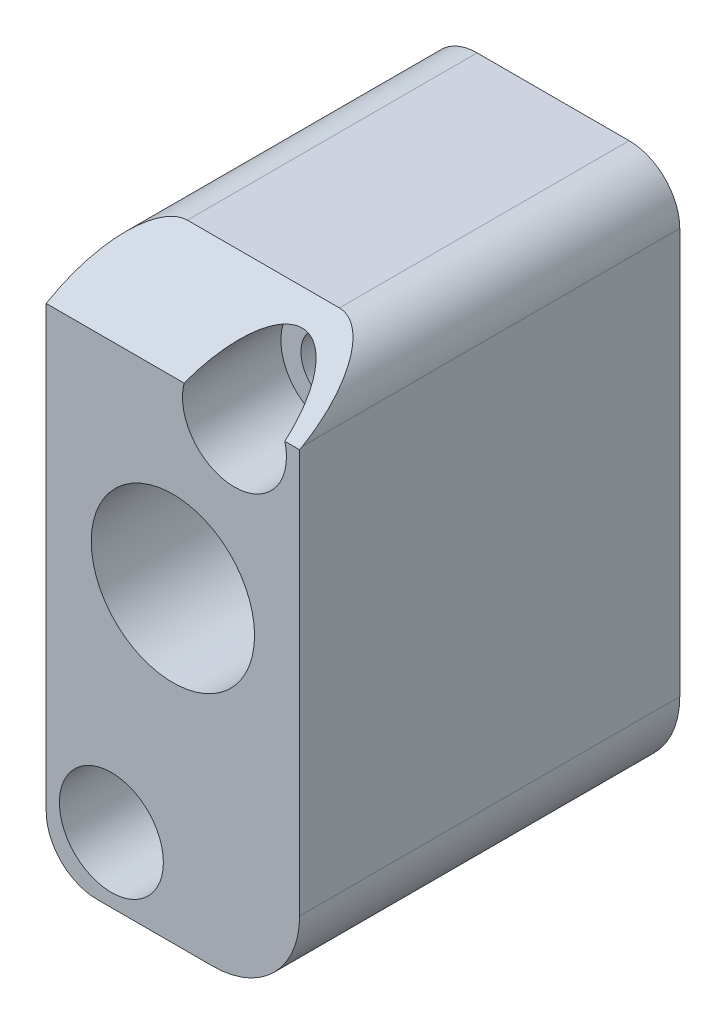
ISO-10303-21;
HEADER;
FILE_DESCRIPTION(('STEP AP214'),'2;1');
FILE_NAME('part.step','',(''),(''),'','','');
FILE_SCHEMA(('AUTOMOTIVE_DESIGN { 1 0 10303 214 1 1 1 1 }'));
ENDSEC;
DATA;
#1=APPLICATION_CONTEXT('core data for automotive mechanical design processes');
#2=APPLICATION_PROTOCOL_DEFINITION('international standard','automotive_design',2000,#1);
#3=PRODUCT_CONTEXT('',#1,'mechanical');
#4=PRODUCT('Part','Part','',(#3));
#5=PRODUCT_RELATED_PRODUCT_CATEGORY('part','',(#4));
#6=PRODUCT_DEFINITION_FORMATION('','',#4);
#7=PRODUCT_DEFINITION_CONTEXT('part definition',#1,'design');
#8=PRODUCT_DEFINITION('design','',#6,#7);
#9=PRODUCT_DEFINITION_SHAPE('','',#8);
#10=(LENGTH_UNIT() NAMED_UNIT(*) SI_UNIT(.MILLI.,.METRE.));
#11=(NAMED_UNIT(*) PLANE_ANGLE_UNIT() SI_UNIT($,.RADIAN.));
#12=(NAMED_UNIT(*) SI_UNIT($,.STERADIAN.) SOLID_ANGLE_UNIT());
#13=UNCERTAINTY_MEASURE_WITH_UNIT(LENGTH_MEASURE(1.E-05),#10,'distance_accuracy_value','');
#14=(GEOMETRIC_REPRESENTATION_CONTEXT(3) GLOBAL_UNCERTAINTY_ASSIGNED_CONTEXT((#13)) GLOBAL_UNIT_ASSIGNED_CONTEXT((#10,
#11,#12)) REPRESENTATION_CONTEXT('',''));
#15=CARTESIAN_POINT('',(0.,0.,0.));
#16=DIRECTION('',(0.,0.,1.));
#17=DIRECTION('',(1.,0.,0.));
#18=AXIS2_PLACEMENT_3D('',#15,#16,#17);
#19=CARTESIAN_POINT('',(-754.411295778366,-14.7238728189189,1.5998698));
#20=DIRECTION('',(0.,0.,-1.));
#21=DIRECTION('',(-1.,0.,0.));
#22=AXIS2_PLACEMENT_3D('',#19,#20,#21);
#23=CYLINDRICAL_SURFACE('',#22,4.44500000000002);
#24=DIRECTION('',(0.,0.,-1.));
#25=VECTOR('',#24,1.);
#26=CARTESIAN_POINT('',(-754.411295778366,-10.2788728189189,1.5998698));
#27=LINE('',#26,#25);
#28=CARTESIAN_POINT('',(-754.411295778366,-10.2788728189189,-6.33763020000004));
#29=VERTEX_POINT('',#28);
#30=CARTESIAN_POINT('',(-754.411295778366,-10.2788728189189,-31.75));
#31=VERTEX_POINT('',#30);
#32=EDGE_CURVE('E163',#29,#31,#27,.T.);
#33=ORIENTED_EDGE('',*,*,#32,.F.);
#34=CARTESIAN_POINT('',(-754.411295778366,-14.7238728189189,1.36133563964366));
#35=DIRECTION('',(0.,-0.86602540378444,-0.499999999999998));
#36=DIRECTION('',(0.,0.499999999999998,-0.86602540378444));
#37=AXIS2_PLACEMENT_3D('',#34,#35,#36);
#38=ELLIPSE('',#37,8.89000000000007,4.44500000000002);
#39=CARTESIAN_POINT('',(-749.966295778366,-14.7238728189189,1.36133563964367));
#40=VERTEX_POINT('',#39);
#41=EDGE_CURVE('E95',#29,#40,#38,.T.);
#42=ORIENTED_EDGE('',*,*,#41,.T.);
#43=DIRECTION('',(0.,0.,-1.));
#44=VECTOR('',#43,1.);
#45=CARTESIAN_POINT('',(-749.966295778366,-14.7238728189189,1.5998698));
#46=LINE('',#45,#44);
#47=CARTESIAN_POINT('',(-749.966295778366,-14.7238728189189,-31.75));
#48=VERTEX_POINT('',#47);
#49=EDGE_CURVE('E184',#40,#48,#46,.T.);
#50=ORIENTED_EDGE('',*,*,#49,.T.);
#51=CARTESIAN_POINT('',(-754.411295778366,-14.7238728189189,-31.75));
#52=DIRECTION('',(0.,0.,1.));
#53=DIRECTION('',(-1.,0.,0.));
#54=AXIS2_PLACEMENT_3D('',#51,#52,#53);
#55=CIRCLE('',#54,4.44500000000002);
#56=EDGE_CURVE('E177',#48,#31,#55,.T.);
#57=ORIENTED_EDGE('',*,*,#56,.T.);
#58=EDGE_LOOP('',(#33,#42,#50,#57));
#59=FACE_BOUND('',#58,.T.);
#60=ADVANCED_FACE('F85',(#59),#23,.T.);
#61=CARTESIAN_POINT('',(-767.746295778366,-10.2788728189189,1.5998698));
#62=DIRECTION('',(0.,-1.,0.));
#63=DIRECTION('',(1.,0.,0.));
#64=AXIS2_PLACEMENT_3D('',#61,#62,#63);
#65=PLANE('',#64);
#66=DIRECTION('',(0.,0.,-1.));
#67=VECTOR('',#66,1.);
#68=CARTESIAN_POINT('',(-767.746295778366,-10.2788728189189,1.5998698));
#69=LINE('',#68,#67);
#70=CARTESIAN_POINT('',(-767.746295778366,-10.2788728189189,-6.33763020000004));
#71=VERTEX_POINT('',#70);
#72=CARTESIAN_POINT('',(-767.746295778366,-10.2788728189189,-31.75));
#73=VERTEX_POINT('',#72);
#74=EDGE_CURVE('E170',#71,#73,#69,.T.);
#75=ORIENTED_EDGE('',*,*,#74,.F.);
#76=DIRECTION('',(1.,0.,0.));
#77=VECTOR('',#76,1.);
#78=CARTESIAN_POINT('',(-767.746295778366,-10.2788728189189,-6.33763020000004));
#79=LINE('',#78,#77);
#80=EDGE_CURVE('E109',#71,#29,#79,.T.);
#81=ORIENTED_EDGE('',*,*,#80,.T.);
#82=ORIENTED_EDGE('',*,*,#32,.T.);
#83=DIRECTION('',(-1.,0.,0.));
#84=VECTOR('',#83,1.);
#85=CARTESIAN_POINT('',(-767.746295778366,-10.2788728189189,-31.75));
#86=LINE('',#85,#84);
#87=EDGE_CURVE('E166',#31,#73,#86,.T.);
#88=ORIENTED_EDGE('',*,*,#87,.T.);
#89=EDGE_LOOP('',(#75,#81,#82,#88));
#90=FACE_BOUND('',#89,.T.);
#91=ADVANCED_FACE('F165',(#90),#65,.F.);
#92=CARTESIAN_POINT('',(-767.746295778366,-14.7238728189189,1.5998698));
#93=DIRECTION('',(0.,0.,-1.));
#94=DIRECTION('',(-1.,0.,0.));
#95=AXIS2_PLACEMENT_3D('',#92,#93,#94);
#96=CYLINDRICAL_SURFACE('',#95,4.44500000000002);
#97=DIRECTION('',(0.,0.,-1.));
#98=VECTOR('',#97,1.);
#99=CARTESIAN_POINT('',(-772.191295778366,-14.7238728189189,1.5998698));
#100=LINE('',#99,#98);
#101=CARTESIAN_POINT('',(-772.191295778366,-14.7238728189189,1.36133563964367));
#102=VERTEX_POINT('',#101);
#103=CARTESIAN_POINT('',(-772.191295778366,-14.7238728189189,-31.75));
#104=VERTEX_POINT('',#103);
#105=EDGE_CURVE('E246',#102,#104,#100,.T.);
#106=ORIENTED_EDGE('',*,*,#105,.F.);
#107=CARTESIAN_POINT('',(-767.746295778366,-14.7238728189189,1.36133563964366));
#108=DIRECTION('',(0.,-0.86602540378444,-0.499999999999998));
#109=DIRECTION('',(0.,0.499999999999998,-0.86602540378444));
#110=AXIS2_PLACEMENT_3D('',#107,#108,#109);
#111=ELLIPSE('',#110,8.89000000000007,4.44500000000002);
#112=EDGE_CURVE('E263',#102,#71,#111,.T.);
#113=ORIENTED_EDGE('',*,*,#112,.T.);
#114=ORIENTED_EDGE('',*,*,#74,.T.);
#115=CARTESIAN_POINT('',(-767.746295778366,-14.7238728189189,-31.75));
#116=DIRECTION('',(0.,0.,1.));
#117=DIRECTION('',(1.,0.,0.));
#118=AXIS2_PLACEMENT_3D('',#115,#116,#117);
#119=CIRCLE('',#118,4.44500000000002);
#120=EDGE_CURVE('E181',#73,#104,#119,.T.);
#121=ORIENTED_EDGE('',*,*,#120,.T.);
#122=EDGE_LOOP('',(#106,#113,#114,#121));
#123=FACE_BOUND('',#122,.T.);
#124=ADVANCED_FACE('F346',(#123),#96,.T.);
#125=CARTESIAN_POINT('',(-772.191295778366,-14.7238728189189,1.5998698));
#126=DIRECTION('',(1.,0.,0.));
#127=DIRECTION('',(0.,0.,-1.));
#128=AXIS2_PLACEMENT_3D('',#125,#126,#127);
#129=PLANE('',#128);
#130=DIRECTION('',(0.,-1.,0.));
#131=VECTOR('',#130,1.);
#132=CARTESIAN_POINT('',(-772.191295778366,-14.7238728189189,1.5998698));
#133=LINE('',#132,#131);
#134=CARTESIAN_POINT('',(-772.191295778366,-14.8615905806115,1.5998698));
#135=VERTEX_POINT('',#134);
#136=CARTESIAN_POINT('',(-772.191295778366,-53.4588728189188,1.5998698));
#137=VERTEX_POINT('',#136);
#138=EDGE_CURVE('E217',#135,#137,#133,.T.);
#139=ORIENTED_EDGE('',*,*,#138,.F.);
#140=DIRECTION('',(0.,-0.499999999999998,0.86602540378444));
#141=VECTOR('',#140,1.);
#142=CARTESIAN_POINT('',(-772.191295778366,-14.8615905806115,1.5998698));
#143=LINE('',#142,#141);
#144=EDGE_CURVE('E260',#135,#102,#143,.F.);
#145=ORIENTED_EDGE('',*,*,#144,.T.);
#146=ORIENTED_EDGE('',*,*,#105,.T.);
#147=DIRECTION('',(0.,-1.,0.));
#148=VECTOR('',#147,1.);
#149=CARTESIAN_POINT('',(-772.191295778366,-14.7238728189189,-31.75));
#150=LINE('',#149,#148);
#151=CARTESIAN_POINT('',(-772.191295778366,-53.4588728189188,-31.75));
#152=VERTEX_POINT('',#151);
#153=EDGE_CURVE('E198',#104,#152,#150,.T.);
#154=ORIENTED_EDGE('',*,*,#153,.T.);
#155=DIRECTION('',(0.,0.,-1.));
#156=VECTOR('',#155,1.);
#157=CARTESIAN_POINT('',(-772.191295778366,-53.4588728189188,1.5998698));
#158=LINE('',#157,#156);
#159=EDGE_CURVE('E243',#137,#152,#158,.T.);
#160=ORIENTED_EDGE('',*,*,#159,.F.);
#161=EDGE_LOOP('',(#139,#145,#146,#154,#160));
#162=FACE_BOUND('',#161,.T.);
#163=ADVANCED_FACE('F351',(#162),#129,.F.);
#164=CARTESIAN_POINT('',(-767.746295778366,-53.4588728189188,1.5998698));
#165=DIRECTION('',(0.,0.,-1.));
#166=DIRECTION('',(-1.,0.,0.));
#167=AXIS2_PLACEMENT_3D('',#164,#165,#166);
#168=CYLINDRICAL_SURFACE('',#167,4.44500000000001);
#169=ORIENTED_EDGE('',*,*,#159,.T.);
#170=CARTESIAN_POINT('',(-767.746295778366,-53.4588728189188,-31.75));
#171=DIRECTION('',(0.,0.,1.));
#172=DIRECTION('',(1.,0.,0.));
#173=AXIS2_PLACEMENT_3D('',#170,#171,#172);
#174=CIRCLE('',#173,4.44500000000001);
#175=CARTESIAN_POINT('',(-767.746295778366,-57.9038728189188,-31.75));
#176=VERTEX_POINT('',#175);
#177=EDGE_CURVE('E202',#152,#176,#174,.T.);
#178=ORIENTED_EDGE('',*,*,#177,.T.);
#179=DIRECTION('',(0.,0.,-1.));
#180=VECTOR('',#179,1.);
#181=CARTESIAN_POINT('',(-767.746295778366,-57.9038728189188,1.5998698));
#182=LINE('',#181,#180);
#183=CARTESIAN_POINT('',(-767.746295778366,-57.9038728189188,1.5998698));
#184=VERTEX_POINT('',#183);
#185=EDGE_CURVE('E240',#184,#176,#182,.T.);
#186=ORIENTED_EDGE('',*,*,#185,.F.);
#187=CARTESIAN_POINT('',(-767.746295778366,-53.4588728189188,1.5998698));
#188=DIRECTION('',(0.,0.,1.));
#189=DIRECTION('',(1.,0.,0.));
#190=AXIS2_PLACEMENT_3D('',#187,#188,#189);
#191=CIRCLE('',#190,4.44500000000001);
#192=EDGE_CURVE('E220',#137,#184,#191,.T.);
#193=ORIENTED_EDGE('',*,*,#192,.F.);
#194=EDGE_LOOP('',(#169,#178,#186,#193));
#195=FACE_BOUND('',#194,.T.);
#196=ADVANCED_FACE('F355',(#195),#168,.T.);
#197=CARTESIAN_POINT('',(-767.746295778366,-57.9038728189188,1.5998698));
#198=DIRECTION('',(0.,1.,0.));
#199=DIRECTION('',(0.,0.,1.));
#200=AXIS2_PLACEMENT_3D('',#197,#198,#199);
#201=PLANE('',#200);
#202=ORIENTED_EDGE('',*,*,#185,.T.);
#203=DIRECTION('',(1.,0.,0.));
#204=VECTOR('',#203,1.);
#205=CARTESIAN_POINT('',(-767.746295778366,-57.9038728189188,-31.75));
#206=LINE('',#205,#204);
#207=CARTESIAN_POINT('',(-757.586295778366,-57.9038728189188,-31.75));
#208=VERTEX_POINT('',#207);
#209=EDGE_CURVE('E206',#176,#208,#206,.T.);
#210=ORIENTED_EDGE('',*,*,#209,.T.);
#211=DIRECTION('',(0.,0.,-1.));
#212=VECTOR('',#211,1.);
#213=CARTESIAN_POINT('',(-757.586295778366,-57.9038728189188,1.5998698));
#214=LINE('',#213,#212);
#215=CARTESIAN_POINT('',(-757.586295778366,-57.9038728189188,1.5998698));
#216=VERTEX_POINT('',#215);
#217=EDGE_CURVE('E237',#216,#208,#214,.T.);
#218=ORIENTED_EDGE('',*,*,#217,.F.);
#219=DIRECTION('',(1.,0.,0.));
#220=VECTOR('',#219,1.);
#221=CARTESIAN_POINT('',(-767.746295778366,-57.9038728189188,1.5998698));
#222=LINE('',#221,#220);
#223=EDGE_CURVE('E223',#184,#216,#222,.T.);
#224=ORIENTED_EDGE('',*,*,#223,.F.);
#225=EDGE_LOOP('',(#202,#210,#218,#224));
#226=FACE_BOUND('',#225,.T.);
#227=ADVANCED_FACE('F359',(#226),#201,.F.);
#228=CARTESIAN_POINT('',(-757.586295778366,-50.2838728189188,1.5998698));
#229=DIRECTION('',(0.,0.,-1.));
#230=DIRECTION('',(-1.,0.,0.));
#231=AXIS2_PLACEMENT_3D('',#228,#229,#230);
#232=CYLINDRICAL_SURFACE('',#231,7.61999999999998);
#233=ORIENTED_EDGE('',*,*,#217,.T.);
#234=CARTESIAN_POINT('',(-757.586295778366,-50.2838728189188,-31.75));
#235=DIRECTION('',(0.,0.,1.));
#236=DIRECTION('',(1.,0.,0.));
#237=AXIS2_PLACEMENT_3D('',#234,#235,#236);
#238=CIRCLE('',#237,7.61999999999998);
#239=CARTESIAN_POINT('',(-749.966295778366,-50.2838728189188,-31.75));
#240=VERTEX_POINT('',#239);
#241=EDGE_CURVE('E210',#208,#240,#238,.T.);
#242=ORIENTED_EDGE('',*,*,#241,.T.);
#243=DIRECTION('',(0.,0.,-1.));
#244=VECTOR('',#243,1.);
#245=CARTESIAN_POINT('',(-749.966295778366,-50.2838728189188,1.5998698));
#246=LINE('',#245,#244);
#247=CARTESIAN_POINT('',(-749.966295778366,-50.2838728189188,1.5998698));
#248=VERTEX_POINT('',#247);
#249=EDGE_CURVE('E234',#248,#240,#246,.T.);
#250=ORIENTED_EDGE('',*,*,#249,.F.);
#251=CARTESIAN_POINT('',(-757.586295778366,-50.2838728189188,1.5998698));
#252=DIRECTION('',(0.,0.,1.));
#253=DIRECTION('',(1.,0.,0.));
#254=AXIS2_PLACEMENT_3D('',#251,#252,#253);
#255=CIRCLE('',#254,7.61999999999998);
#256=EDGE_CURVE('E226',#216,#248,#255,.T.);
#257=ORIENTED_EDGE('',*,*,#256,.F.);
#258=EDGE_LOOP('',(#233,#242,#250,#257));
#259=FACE_BOUND('',#258,.T.);
#260=ADVANCED_FACE('F363',(#259),#232,.T.);
#261=CARTESIAN_POINT('',(-749.966295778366,-14.7238728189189,1.5998698));
#262=DIRECTION('',(-1.,0.,0.));
#263=DIRECTION('',(0.,0.,1.));
#264=AXIS2_PLACEMENT_3D('',#261,#262,#263);
#265=PLANE('',#264);
#266=ORIENTED_EDGE('',*,*,#49,.F.);
#267=DIRECTION('',(0.,0.499999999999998,-0.86602540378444));
#268=VECTOR('',#267,1.);
#269=CARTESIAN_POINT('',(-749.966295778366,-14.8615905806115,1.5998698));
#270=LINE('',#269,#268);
#271=CARTESIAN_POINT('',(-749.966295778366,-14.8615905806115,1.5998698));
#272=VERTEX_POINT('',#271);
#273=EDGE_CURVE('E12',#40,#272,#270,.F.);
#274=ORIENTED_EDGE('',*,*,#273,.T.);
#275=DIRECTION('',(0.,1.,0.));
#276=VECTOR('',#275,1.);
#277=CARTESIAN_POINT('',(-749.966295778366,-14.7238728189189,1.5998698));
#278=LINE('',#277,#276);
#279=EDGE_CURVE('E229',#248,#272,#278,.T.);
#280=ORIENTED_EDGE('',*,*,#279,.F.);
#281=ORIENTED_EDGE('',*,*,#249,.T.);
#282=DIRECTION('',(0.,1.,0.));
#283=VECTOR('',#282,1.);
#284=CARTESIAN_POINT('',(-749.966295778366,-14.7238728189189,-31.75));
#285=LINE('',#284,#283);
#286=EDGE_CURVE('E214',#240,#48,#285,.T.);
#287=ORIENTED_EDGE('',*,*,#286,.T.);
#288=EDGE_LOOP('',(#266,#274,#280,#281,#287));
#289=FACE_BOUND('',#288,.T.);
#290=ADVANCED_FACE('F335',(#289),#265,.F.);
#291=CARTESIAN_POINT('',(-754.411295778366,-14.7238728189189,1.5998698));
#292=DIRECTION('',(0.,0.,-1.));
#293=DIRECTION('',(-1.,0.,0.));
#294=AXIS2_PLACEMENT_3D('',#291,#292,#293);
#295=PLANE('',#294);
#296=ORIENTED_EDGE('',*,*,#279,.T.);
#297=DIRECTION('',(-1.,0.,0.));
#298=VECTOR('',#297,1.);
#299=CARTESIAN_POINT('',(-754.411295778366,-14.8615905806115,1.5998698));
#300=LINE('',#299,#298);
#301=CARTESIAN_POINT('',(-751.26483187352,-14.8615905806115,1.5998698));
#302=VERTEX_POINT('',#301);
#303=EDGE_CURVE('E253',#272,#302,#300,.T.);
#304=ORIENTED_EDGE('',*,*,#303,.T.);
#305=CARTESIAN_POINT('',(-755.681295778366,-15.9938728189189,1.5998698));
#306=DIRECTION('',(0.,0.,1.));
#307=DIRECTION('',(1.,0.,0.));
#308=AXIS2_PLACEMENT_3D('',#305,#306,#307);
#309=CIRCLE('',#308,4.55930000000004);
#310=CARTESIAN_POINT('',(-760.097759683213,-14.8615905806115,1.5998698));
#311=VERTEX_POINT('',#310);
#312=EDGE_CURVE('E280',#311,#302,#309,.T.);
#313=ORIENTED_EDGE('',*,*,#312,.F.);
#314=DIRECTION('',(-1.,0.,0.));
#315=VECTOR('',#314,1.);
#316=CARTESIAN_POINT('',(-754.411295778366,-14.8615905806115,1.5998698));
#317=LINE('',#316,#315);
#318=EDGE_CURVE('E169',#311,#135,#317,.T.);
#319=ORIENTED_EDGE('',*,*,#318,.T.);
#320=ORIENTED_EDGE('',*,*,#138,.T.);
#321=ORIENTED_EDGE('',*,*,#192,.T.);
#322=ORIENTED_EDGE('',*,*,#223,.T.);
#323=ORIENTED_EDGE('',*,*,#256,.T.);
#324=EDGE_LOOP('',(#296,#304,#313,#319,#320,#321,#322,#323));
#325=FACE_BOUND('',#324,.T.);
#326=CARTESIAN_POINT('',(-766.476295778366,-52.1888728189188,1.5998698));
#327=DIRECTION('',(0.,0.,1.));
#328=DIRECTION('',(1.,0.,0.));
#329=AXIS2_PLACEMENT_3D('',#326,#327,#328);
#330=CIRCLE('',#329,4.55930000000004);
#331=CARTESIAN_POINT('',(-761.916995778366,-52.1888728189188,1.5998698));
#332=VERTEX_POINT('',#331);
#333=EDGE_CURVE('E270',#332,#332,#330,.T.);
#334=ORIENTED_EDGE('',*,*,#333,.F.);
#335=EDGE_LOOP('',(#334));
#336=FACE_BOUND('',#335,.T.);
#337=CARTESIAN_POINT('',(-761.078795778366,-30.9504062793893,1.5998698));
#338=DIRECTION('',(0.,0.,-1.));
#339=DIRECTION('',(-1.,0.,0.));
#340=AXIS2_PLACEMENT_3D('',#337,#338,#339);
#341=CIRCLE('',#340,7.16280000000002);
#342=CARTESIAN_POINT('',(-768.241595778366,-30.9504062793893,1.5998698));
#343=VERTEX_POINT('',#342);
#344=EDGE_CURVE('E186',#343,#343,#341,.T.);
#345=ORIENTED_EDGE('',*,*,#344,.T.);
#346=EDGE_LOOP('',(#345));
#347=FACE_BOUND('',#346,.T.);
#348=ADVANCED_FACE('F327',(#325,#336,#347),#295,.F.);
#349=CARTESIAN_POINT('',(-754.411295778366,-14.7238728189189,-31.75));
#350=DIRECTION('',(0.,0.,-1.));
#351=DIRECTION('',(-1.,0.,0.));
#352=AXIS2_PLACEMENT_3D('',#349,#350,#351);
#353=PLANE('',#352);
#354=CARTESIAN_POINT('',(-755.681295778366,-15.9938728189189,-31.75));
#355=DIRECTION('',(0.,0.,1.));
#356=DIRECTION('',(1.,0.,0.));
#357=AXIS2_PLACEMENT_3D('',#354,#355,#356);
#358=CIRCLE('',#357,2.80669999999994);
#359=CARTESIAN_POINT('',(-752.874595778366,-15.9938728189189,-31.75));
#360=VERTEX_POINT('',#359);
#361=EDGE_CURVE('E292',#360,#360,#358,.T.);
#362=ORIENTED_EDGE('',*,*,#361,.T.);
#363=EDGE_LOOP('',(#362));
#364=FACE_BOUND('',#363,.T.);
#365=CARTESIAN_POINT('',(-766.476295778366,-52.1888728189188,-31.75));
#366=DIRECTION('',(0.,0.,1.));
#367=DIRECTION('',(1.,0.,0.));
#368=AXIS2_PLACEMENT_3D('',#365,#366,#367);
#369=CIRCLE('',#368,2.80669999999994);
#370=CARTESIAN_POINT('',(-763.669595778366,-52.1888728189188,-31.75));
#371=VERTEX_POINT('',#370);
#372=EDGE_CURVE('E276',#371,#371,#369,.T.);
#373=ORIENTED_EDGE('',*,*,#372,.T.);
#374=EDGE_LOOP('',(#373));
#375=FACE_BOUND('',#374,.T.);
#376=CARTESIAN_POINT('',(-761.078795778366,-30.9504062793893,-31.75));
#377=DIRECTION('',(0.,0.,-1.));
#378=DIRECTION('',(-1.,0.,0.));
#379=AXIS2_PLACEMENT_3D('',#376,#377,#378);
#380=CIRCLE('',#379,9.65199999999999);
#381=CARTESIAN_POINT('',(-770.730795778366,-30.9504062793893,-31.75));
#382=VERTEX_POINT('',#381);
#383=EDGE_CURVE('E273',#382,#382,#380,.T.);
#384=ORIENTED_EDGE('',*,*,#383,.F.);
#385=EDGE_LOOP('',(#384));
#386=FACE_BOUND('',#385,.T.);
#387=ORIENTED_EDGE('',*,*,#56,.F.);
#388=ORIENTED_EDGE('',*,*,#286,.F.);
#389=ORIENTED_EDGE('',*,*,#241,.F.);
#390=ORIENTED_EDGE('',*,*,#209,.F.);
#391=ORIENTED_EDGE('',*,*,#177,.F.);
#392=ORIENTED_EDGE('',*,*,#153,.F.);
#393=ORIENTED_EDGE('',*,*,#120,.F.);
#394=ORIENTED_EDGE('',*,*,#87,.F.);
#395=EDGE_LOOP('',(#387,#388,#389,#390,#391,#392,#393,#394));
#396=FACE_BOUND('',#395,.T.);
#397=ADVANCED_FACE('F175',(#364,#375,#386,#396),#353,.T.);
#398=CARTESIAN_POINT('',(-761.078795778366,-30.9504062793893,-31.75));
#399=DIRECTION('',(0.,0.,-1.));
#400=DIRECTION('',(-1.,0.,0.));
#401=AXIS2_PLACEMENT_3D('',#398,#399,#400);
#402=CYLINDRICAL_SURFACE('',#401,7.16280000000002);
#403=ORIENTED_EDGE('',*,*,#344,.F.);
#404=EDGE_LOOP('',(#403));
#405=FACE_BOUND('',#404,.T.);
#406=CARTESIAN_POINT('',(-761.078795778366,-30.9504062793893,-21.844));
#407=DIRECTION('',(0.,0.,-1.));
#408=DIRECTION('',(-1.,0.,0.));
#409=AXIS2_PLACEMENT_3D('',#406,#407,#408);
#410=CIRCLE('',#409,7.16280000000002);
#411=CARTESIAN_POINT('',(-768.241595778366,-30.9504062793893,-21.844));
#412=VERTEX_POINT('',#411);
#413=EDGE_CURVE('E192',#412,#412,#410,.T.);
#414=ORIENTED_EDGE('',*,*,#413,.T.);
#415=EDGE_LOOP('',(#414));
#416=FACE_BOUND('',#415,.T.);
#417=ADVANCED_FACE('F311',(#405,#416),#402,.F.);
#418=CARTESIAN_POINT('',(-753.915995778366,-30.9504062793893,-21.844));
#419=DIRECTION('',(0.,0.,1.));
#420=DIRECTION('',(1.,0.,0.));
#421=AXIS2_PLACEMENT_3D('',#418,#419,#420);
#422=PLANE('',#421);
#423=ORIENTED_EDGE('',*,*,#413,.F.);
#424=EDGE_LOOP('',(#423));
#425=FACE_BOUND('',#424,.T.);
#426=CARTESIAN_POINT('',(-761.078795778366,-30.9504062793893,-21.844));
#427=DIRECTION('',(0.,0.,-1.));
#428=DIRECTION('',(-1.,0.,0.));
#429=AXIS2_PLACEMENT_3D('',#426,#427,#428);
#430=CIRCLE('',#429,9.65199999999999);
#431=CARTESIAN_POINT('',(-770.730795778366,-30.9504062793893,-21.844));
#432=VERTEX_POINT('',#431);
#433=EDGE_CURVE('E304',#432,#432,#430,.T.);
#434=ORIENTED_EDGE('',*,*,#433,.T.);
#435=EDGE_LOOP('',(#434));
#436=FACE_BOUND('',#435,.T.);
#437=ADVANCED_FACE('F313',(#425,#436),#422,.F.);
#438=CARTESIAN_POINT('',(-761.078795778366,-30.9504062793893,-31.75));
#439=DIRECTION('',(0.,0.,-1.));
#440=DIRECTION('',(-1.,0.,0.));
#441=AXIS2_PLACEMENT_3D('',#438,#439,#440);
#442=CYLINDRICAL_SURFACE('',#441,9.65199999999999);
#443=ORIENTED_EDGE('',*,*,#433,.F.);
#444=EDGE_LOOP('',(#443));
#445=FACE_BOUND('',#444,.T.);
#446=ORIENTED_EDGE('',*,*,#383,.T.);
#447=EDGE_LOOP('',(#446));
#448=FACE_BOUND('',#447,.T.);
#449=ADVANCED_FACE('F316',(#445,#448),#442,.F.);
#450=CARTESIAN_POINT('',(-766.476295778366,-52.1888728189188,1.5998698));
#451=DIRECTION('',(0.,0.,1.));
#452=DIRECTION('',(1.,0.,0.));
#453=AXIS2_PLACEMENT_3D('',#450,#451,#452);
#454=CYLINDRICAL_SURFACE('',#453,4.55930000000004);
#455=CARTESIAN_POINT('',(-766.476295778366,-52.1888728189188,-7.0361302));
#456=DIRECTION('',(0.,0.,1.));
#457=DIRECTION('',(1.,0.,0.));
#458=AXIS2_PLACEMENT_3D('',#455,#456,#457);
#459=CIRCLE('',#458,4.55930000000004);
#460=CARTESIAN_POINT('',(-761.916995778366,-52.1888728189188,-7.0361302));
#461=VERTEX_POINT('',#460);
#462=EDGE_CURVE('E274',#461,#461,#459,.T.);
#463=ORIENTED_EDGE('',*,*,#462,.F.);
#464=EDGE_LOOP('',(#463));
#465=FACE_BOUND('',#464,.T.);
#466=ORIENTED_EDGE('',*,*,#333,.T.);
#467=EDGE_LOOP('',(#466));
#468=FACE_BOUND('',#467,.T.);
#469=ADVANCED_FACE('F322',(#465,#468),#454,.F.);
#470=CARTESIAN_POINT('',(-763.669595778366,-52.1888728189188,-7.0361302));
#471=DIRECTION('',(0.,0.,-1.));
#472=DIRECTION('',(-1.,0.,0.));
#473=AXIS2_PLACEMENT_3D('',#470,#471,#472);
#474=PLANE('',#473);
#475=CARTESIAN_POINT('',(-766.476295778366,-52.1888728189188,-7.0361302));
#476=DIRECTION('',(0.,0.,1.));
#477=DIRECTION('',(1.,0.,0.));
#478=AXIS2_PLACEMENT_3D('',#475,#476,#477);
#479=CIRCLE('',#478,2.80670000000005);
#480=CARTESIAN_POINT('',(-763.669595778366,-52.1888728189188,-7.0361302));
#481=VERTEX_POINT('',#480);
#482=EDGE_CURVE('E279',#481,#481,#479,.T.);
#483=ORIENTED_EDGE('',*,*,#482,.F.);
#484=EDGE_LOOP('',(#483));
#485=FACE_BOUND('',#484,.T.);
#486=ORIENTED_EDGE('',*,*,#462,.T.);
#487=EDGE_LOOP('',(#486));
#488=FACE_BOUND('',#487,.T.);
#489=ADVANCED_FACE('F393',(#485,#488),#474,.F.);
#490=CARTESIAN_POINT('',(-766.476295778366,-52.1888728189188,1.5998698));
#491=DIRECTION('',(0.,0.,1.));
#492=DIRECTION('',(1.,0.,0.));
#493=AXIS2_PLACEMENT_3D('',#490,#491,#492);
#494=CYLINDRICAL_SURFACE('',#493,2.8067);
#495=ORIENTED_EDGE('',*,*,#372,.F.);
#496=EDGE_LOOP('',(#495));
#497=FACE_BOUND('',#496,.T.);
#498=ORIENTED_EDGE('',*,*,#482,.T.);
#499=EDGE_LOOP('',(#498));
#500=FACE_BOUND('',#499,.T.);
#501=ADVANCED_FACE('F382',(#497,#500),#494,.F.);
#502=CARTESIAN_POINT('',(-755.681295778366,-15.9938728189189,1.5998698));
#503=DIRECTION('',(0.,0.,1.));
#504=DIRECTION('',(1.,0.,0.));
#505=AXIS2_PLACEMENT_3D('',#502,#503,#504);
#506=CYLINDRICAL_SURFACE('',#505,4.55930000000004);
#507=CARTESIAN_POINT('',(-755.681295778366,-15.9938728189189,-7.0361302));
#508=DIRECTION('',(0.,0.,1.));
#509=DIRECTION('',(1.,0.,0.));
#510=AXIS2_PLACEMENT_3D('',#507,#508,#509);
#511=CIRCLE('',#510,4.55930000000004);
#512=CARTESIAN_POINT('',(-751.121995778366,-15.9938728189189,-7.0361302));
#513=VERTEX_POINT('',#512);
#514=EDGE_CURVE('E282',#513,#513,#511,.T.);
#515=ORIENTED_EDGE('',*,*,#514,.F.);
#516=EDGE_LOOP('',(#515));
#517=FACE_BOUND('',#516,.T.);
#518=ORIENTED_EDGE('',*,*,#312,.T.);
#519=CARTESIAN_POINT('',(-755.681295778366,-15.9938728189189,3.56104016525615));
#520=DIRECTION('',(0.,-0.86602540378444,-0.499999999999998));
#521=DIRECTION('',(0.,-0.499999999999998,0.86602540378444));
#522=AXIS2_PLACEMENT_3D('',#519,#520,#521);
#523=ELLIPSE('',#522,9.11860000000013,4.55930000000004);
#524=EDGE_CURVE('E257',#302,#311,#523,.F.);
#525=ORIENTED_EDGE('',*,*,#524,.T.);
#526=EDGE_LOOP('',(#518,#525));
#527=FACE_BOUND('',#526,.T.);
#528=ADVANCED_FACE('F379',(#517,#527),#506,.F.);
#529=CARTESIAN_POINT('',(-752.874595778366,-15.9938728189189,-7.0361302));
#530=DIRECTION('',(0.,0.,-1.));
#531=DIRECTION('',(-1.,0.,0.));
#532=AXIS2_PLACEMENT_3D('',#529,#530,#531);
#533=PLANE('',#532);
#534=CARTESIAN_POINT('',(-755.681295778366,-15.9938728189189,-7.0361302));
#535=DIRECTION('',(0.,0.,1.));
#536=DIRECTION('',(1.,0.,0.));
#537=AXIS2_PLACEMENT_3D('',#534,#535,#536);
#538=CIRCLE('',#537,2.80670000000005);
#539=CARTESIAN_POINT('',(-752.874595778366,-15.9938728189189,-7.0361302));
#540=VERTEX_POINT('',#539);
#541=EDGE_CURVE('E284',#540,#540,#538,.T.);
#542=ORIENTED_EDGE('',*,*,#541,.F.);
#543=EDGE_LOOP('',(#542));
#544=FACE_BOUND('',#543,.T.);
#545=ORIENTED_EDGE('',*,*,#514,.T.);
#546=EDGE_LOOP('',(#545));
#547=FACE_BOUND('',#546,.T.);
#548=ADVANCED_FACE('F381',(#544,#547),#533,.F.);
#549=CARTESIAN_POINT('',(-755.681295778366,-15.9938728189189,1.5998698));
#550=DIRECTION('',(0.,0.,1.));
#551=DIRECTION('',(1.,0.,0.));
#552=AXIS2_PLACEMENT_3D('',#549,#550,#551);
#553=CYLINDRICAL_SURFACE('',#552,2.8067);
#554=ORIENTED_EDGE('',*,*,#361,.F.);
#555=EDGE_LOOP('',(#554));
#556=FACE_BOUND('',#555,.T.);
#557=ORIENTED_EDGE('',*,*,#541,.T.);
#558=EDGE_LOOP('',(#557));
#559=FACE_BOUND('',#558,.T.);
#560=ADVANCED_FACE('F389',(#556,#559),#553,.F.);
#561=CARTESIAN_POINT('',(-754.411295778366,-14.8615905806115,1.5998698));
#562=DIRECTION('',(0.,-0.86602540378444,-0.499999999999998));
#563=DIRECTION('',(-1.,0.,0.));
#564=AXIS2_PLACEMENT_3D('',#561,#562,#563);
#565=PLANE('',#564);
#566=ORIENTED_EDGE('',*,*,#41,.F.);
#567=ORIENTED_EDGE('',*,*,#80,.F.);
#568=ORIENTED_EDGE('',*,*,#112,.F.);
#569=ORIENTED_EDGE('',*,*,#144,.F.);
#570=ORIENTED_EDGE('',*,*,#318,.F.);
#571=ORIENTED_EDGE('',*,*,#524,.F.);
#572=ORIENTED_EDGE('',*,*,#303,.F.);
#573=ORIENTED_EDGE('',*,*,#273,.F.);
#574=EDGE_LOOP('',(#566,#567,#568,#569,#570,#571,#572,#573));
#575=FACE_BOUND('',#574,.T.);
#576=ADVANCED_FACE('F88',(#575),#565,.F.);
#577=CLOSED_SHELL('',(#60,#91,#124,#163,#196,#227,#260,#290,#348,#397,#417,#437,#449,#469,#489,
#501,#528,#548,#560,#576));
#578=MANIFOLD_SOLID_BREP('B2',#577);
#579=ADVANCED_BREP_SHAPE_REPRESENTATION('',(#18,#578),#14);
#580=SHAPE_DEFINITION_REPRESENTATION(#9,#579);
ENDSEC;
END-ISO-10303-21;
